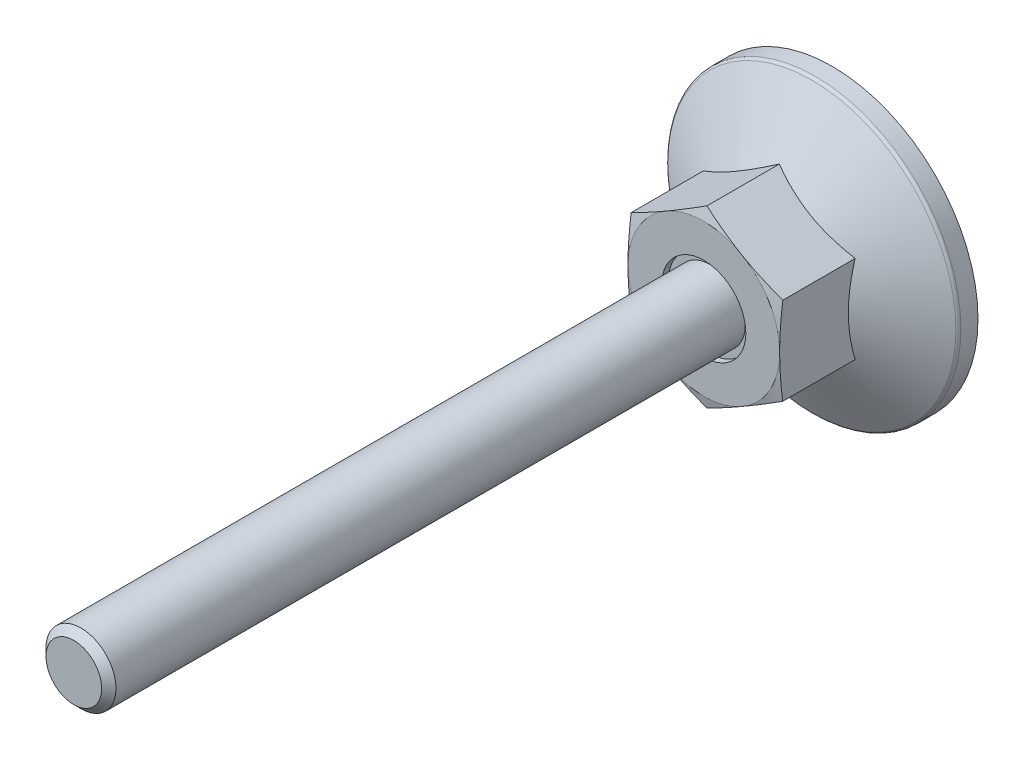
ISO-10303-21;
HEADER;
FILE_DESCRIPTION(('STEP AP214'),'2;1');
FILE_NAME('part.step','',(''),(''),'','','');
FILE_SCHEMA(('AUTOMOTIVE_DESIGN { 1 0 10303 214 1 1 1 1 }'));
ENDSEC;
DATA;
#1=APPLICATION_CONTEXT('core data for automotive mechanical design processes');
#2=APPLICATION_PROTOCOL_DEFINITION('international standard','automotive_design',2000,#1);
#3=PRODUCT_CONTEXT('',#1,'mechanical');
#4=PRODUCT('Part','Part','',(#3));
#5=PRODUCT_RELATED_PRODUCT_CATEGORY('part','',(#4));
#6=PRODUCT_DEFINITION_FORMATION('','',#4);
#7=PRODUCT_DEFINITION_CONTEXT('part definition',#1,'design');
#8=PRODUCT_DEFINITION('design','',#6,#7);
#9=PRODUCT_DEFINITION_SHAPE('','',#8);
#10=(LENGTH_UNIT() NAMED_UNIT(*) SI_UNIT(.MILLI.,.METRE.));
#11=(NAMED_UNIT(*) PLANE_ANGLE_UNIT() SI_UNIT($,.RADIAN.));
#12=(NAMED_UNIT(*) SI_UNIT($,.STERADIAN.) SOLID_ANGLE_UNIT());
#13=UNCERTAINTY_MEASURE_WITH_UNIT(LENGTH_MEASURE(1.E-05),#10,'distance_accuracy_value','');
#14=(GEOMETRIC_REPRESENTATION_CONTEXT(3) GLOBAL_UNCERTAINTY_ASSIGNED_CONTEXT((#13)) GLOBAL_UNIT_ASSIGNED_CONTEXT((#10,
#11,#12)) REPRESENTATION_CONTEXT('',''));
#15=CARTESIAN_POINT('',(0.,0.,0.));
#16=DIRECTION('',(0.,0.,1.));
#17=DIRECTION('',(1.,0.,0.));
#18=AXIS2_PLACEMENT_3D('',#15,#16,#17);
#19=CARTESIAN_POINT('',(0.,0.,10.45));
#20=DIRECTION('',(0.,0.,-1.));
#21=DIRECTION('',(0.,1.,0.));
#22=AXIS2_PLACEMENT_3D('',#19,#20,#21);
#23=PLANE('',#22);
#24=CARTESIAN_POINT('',(0.,0.,10.45));
#25=DIRECTION('',(0.,0.,-1.));
#26=DIRECTION('',(0.,1.,0.));
#27=AXIS2_PLACEMENT_3D('',#24,#25,#26);
#28=CIRCLE('',#27,3.6);
#29=CARTESIAN_POINT('',(0.,3.6,10.45));
#30=VERTEX_POINT('',#29);
#31=EDGE_CURVE('E27',#30,#30,#28,.T.);
#32=ORIENTED_EDGE('',*,*,#31,.F.);
#33=EDGE_LOOP('',(#32));
#34=FACE_BOUND('',#33,.T.);
#35=CARTESIAN_POINT('',(0.,0.,10.45));
#36=DIRECTION('',(0.,0.,-1.));
#37=DIRECTION('',(0.,1.,0.));
#38=AXIS2_PLACEMENT_3D('',#35,#36,#37);
#39=CIRCLE('',#38,3.);
#40=CARTESIAN_POINT('',(0.,3.,10.45));
#41=VERTEX_POINT('',#40);
#42=EDGE_CURVE('E252',#41,#41,#39,.F.);
#43=ORIENTED_EDGE('',*,*,#42,.F.);
#44=EDGE_LOOP('',(#43));
#45=FACE_BOUND('',#44,.T.);
#46=ADVANCED_FACE('F14',(#34,#45),#23,.F.);
#47=CARTESIAN_POINT('',(0.,7.5055534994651,22.));
#48=DIRECTION('',(0.499999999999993,-0.866025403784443,0.));
#49=DIRECTION('',(0.866025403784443,0.499999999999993,0.));
#50=AXIS2_PLACEMENT_3D('',#47,#48,#49);
#51=PLANE('',#50);
#52=CARTESIAN_POINT('',(-6.5002,3.75266127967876,4.53347836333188));
#53=CARTESIAN_POINT('',(-6.35732254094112,3.83515161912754,4.58109719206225));
#54=CARTESIAN_POINT('',(-6.21391236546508,3.91794952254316,4.62655491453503));
#55=CARTESIAN_POINT('',(-5.9259273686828,4.08421773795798,4.71255293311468));
#56=CARTESIAN_POINT('',(-5.78135207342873,4.16768832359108,4.7530911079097));
#57=CARTESIAN_POINT('',(-5.34531134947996,4.41943655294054,4.86653061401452));
#58=CARTESIAN_POINT('',(-5.05212471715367,4.58870793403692,4.93105380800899));
#59=CARTESIAN_POINT('',(-4.61337625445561,4.84201947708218,5.00671503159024));
#60=CARTESIAN_POINT('',(-4.46912536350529,4.92530276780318,5.02826875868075));
#61=CARTESIAN_POINT('',(-4.17997178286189,5.09224566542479,5.06441130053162));
#62=CARTESIAN_POINT('',(-4.03506915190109,5.17590523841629,5.07900073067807));
#63=CARTESIAN_POINT('',(-3.74501222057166,5.34336968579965,5.10084286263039));
#64=CARTESIAN_POINT('',(-3.59985839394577,5.42717428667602,5.10810389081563));
#65=CARTESIAN_POINT('',(-3.30942466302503,5.59485627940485,5.11514131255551));
#66=CARTESIAN_POINT('',(-3.16414476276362,5.67873366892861,5.11491793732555));
#67=CARTESIAN_POINT('',(-2.76612405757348,5.90853103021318,5.1040181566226));
#68=CARTESIAN_POINT('',(-2.51351353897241,6.05437578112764,5.08571979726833));
#69=CARTESIAN_POINT('',(-2.00997032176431,6.34509659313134,5.02769527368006));
#70=CARTESIAN_POINT('',(-1.75903939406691,6.48997163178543,4.9879492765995));
#71=CARTESIAN_POINT('',(-1.25448277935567,6.78127752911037,4.8885957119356));
#72=CARTESIAN_POINT('',(-1.00092075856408,6.92767163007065,4.82856718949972));
#73=CARTESIAN_POINT('',(-0.497578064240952,7.21827667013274,4.69232662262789));
#74=CARTESIAN_POINT('',(-0.247790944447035,7.36249133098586,4.61614658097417));
#75=CARTESIAN_POINT('',(0.000200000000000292,7.50566896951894,4.53347836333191));
#76=B_SPLINE_CURVE_WITH_KNOTS('',3,(#52,#53,#54,#55,#56,#57,#58,#59,#60,#61,#62,#63,#64,#65,#66,
#67,#68,#69,#70,#71,#72,#73,#74,#75),.UNSPECIFIED.,.F.,.F.,(4,2,2,2,2,2,2,2,2,2,2,4),(0.,
0.515105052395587,1.03043143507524,2.06322554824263,2.56697389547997,3.07067772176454,
3.57380860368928,4.07692394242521,4.95279354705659,5.82947446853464,6.72559912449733,
7.61996451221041),.UNSPECIFIED.);
#77=CARTESIAN_POINT('',(-6.5,3.7527767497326,4.53354503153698));
#78=VERTEX_POINT('',#77);
#79=CARTESIAN_POINT('',(0.,7.5055534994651,4.53354503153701));
#80=VERTEX_POINT('',#79);
#81=EDGE_CURVE('E100',#78,#80,#76,.T.);
#82=ORIENTED_EDGE('',*,*,#81,.F.);
#83=DIRECTION('',(0.,0.,-1.));
#84=VECTOR('',#83,1.);
#85=CARTESIAN_POINT('',(-6.5,3.7527767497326,22.));
#86=LINE('',#85,#84);
#87=CARTESIAN_POINT('',(-6.5,3.7527767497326,10.7305627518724));
#88=VERTEX_POINT('',#87);
#89=EDGE_CURVE('E91',#88,#78,#86,.T.);
#90=ORIENTED_EDGE('',*,*,#89,.F.);
#91=CARTESIAN_POINT('',(0.000200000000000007,7.50566896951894,10.7305318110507));
#92=CARTESIAN_POINT('',(-0.269745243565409,7.34981601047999,10.7723102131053));
#93=CARTESIAN_POINT('',(-0.540179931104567,7.19368047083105,10.8102381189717));
#94=CARTESIAN_POINT('',(-1.08200437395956,6.8808579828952,10.876873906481));
#95=CARTESIAN_POINT('',(-1.35339447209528,6.72417083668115,10.9055780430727));
#96=CARTESIAN_POINT('',(-1.89548428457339,6.41119513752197,10.952090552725));
#97=CARTESIAN_POINT('',(-2.16618033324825,6.25490870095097,10.9699543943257));
#98=CARTESIAN_POINT('',(-2.70791763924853,5.94213652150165,10.9939079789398));
#99=CARTESIAN_POINT('',(-2.97895881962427,5.78565082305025,11.));
#100=CARTESIAN_POINT('',(-3.52104118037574,5.47267942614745,11.));
#101=CARTESIAN_POINT('',(-3.79208236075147,5.31619372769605,10.9939079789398));
#102=CARTESIAN_POINT('',(-4.33381966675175,5.00342154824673,10.9699543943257));
#103=CARTESIAN_POINT('',(-4.60451571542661,4.84713511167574,10.952090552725));
#104=CARTESIAN_POINT('',(-5.14660552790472,4.53415941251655,10.9055780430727));
#105=CARTESIAN_POINT('',(-5.41799562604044,4.3774722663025,10.876873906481));
#106=CARTESIAN_POINT('',(-5.95982006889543,4.06464977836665,10.8102381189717));
#107=CARTESIAN_POINT('',(-6.23025475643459,3.90851423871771,10.7723102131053));
#108=CARTESIAN_POINT('',(-6.5002,3.75266127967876,10.7305318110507));
#109=B_SPLINE_CURVE_WITH_KNOTS('',3,(#91,#92,#93,#94,#95,#96,#97,#98,#99,#100,#101,#102,#103,
#104,#105,#106,#107,#108),.UNSPECIFIED.,.F.,.F.,(4,2,2,2,2,2,2,2,4),(0.,0.943529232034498,
1.88744107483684,2.82648138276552,3.76533995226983,4.70419852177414,5.64323882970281,
6.58715067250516,7.53067990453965),.UNSPECIFIED.);
#110=CARTESIAN_POINT('',(-3.24999999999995,5.62916512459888,11.));
#111=VERTEX_POINT('',#110);
#112=EDGE_CURVE('E191',#111,#88,#109,.T.);
#113=ORIENTED_EDGE('',*,*,#112,.F.);
#114=CARTESIAN_POINT('',(0.,7.5055534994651,10.7305627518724));
#115=VERTEX_POINT('',#114);
#116=EDGE_CURVE('E478',#115,#111,#109,.T.);
#117=ORIENTED_EDGE('',*,*,#116,.F.);
#118=DIRECTION('',(0.,0.,-1.));
#119=VECTOR('',#118,1.);
#120=CARTESIAN_POINT('',(0.,7.5055534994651,22.));
#121=LINE('',#120,#119);
#122=EDGE_CURVE('E104',#115,#80,#121,.T.);
#123=ORIENTED_EDGE('',*,*,#122,.T.);
#124=EDGE_LOOP('',(#82,#90,#113,#117,#123));
#125=FACE_BOUND('',#124,.T.);
#126=ADVANCED_FACE('F103',(#125),#51,.F.);
#127=CARTESIAN_POINT('',(6.5,3.7527767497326,22.));
#128=DIRECTION('',(-0.499999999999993,-0.866025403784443,0.));
#129=DIRECTION('',(0.866025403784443,-0.499999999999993,0.));
#130=AXIS2_PLACEMENT_3D('',#127,#128,#129);
#131=PLANE('',#130);
#132=CARTESIAN_POINT('',(-0.0002,7.50566896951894,4.53347836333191));
#133=CARTESIAN_POINT('',(0.142677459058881,7.42317863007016,4.58109719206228));
#134=CARTESIAN_POINT('',(0.286087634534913,7.34038072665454,4.62655491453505));
#135=CARTESIAN_POINT('',(0.574072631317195,7.17411251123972,4.71255293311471));
#136=CARTESIAN_POINT('',(0.718647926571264,7.09064192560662,4.75309110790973));
#137=CARTESIAN_POINT('',(1.15468865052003,6.83889369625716,4.86653061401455));
#138=CARTESIAN_POINT('',(1.44787528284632,6.66962231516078,4.93105380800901));
#139=CARTESIAN_POINT('',(1.88662374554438,6.41631077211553,5.00671503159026));
#140=CARTESIAN_POINT('',(2.03087463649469,6.33302748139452,5.02826875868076));
#141=CARTESIAN_POINT('',(2.32002821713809,6.16608458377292,5.06441130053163));
#142=CARTESIAN_POINT('',(2.46493084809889,6.08242501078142,5.07900073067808));
#143=CARTESIAN_POINT('',(2.75498777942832,5.91496056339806,5.10084286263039));
#144=CARTESIAN_POINT('',(2.90014160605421,5.8311559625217,5.10810389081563));
#145=CARTESIAN_POINT('',(3.19057533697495,5.66347396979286,5.11514131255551));
#146=CARTESIAN_POINT('',(3.33585523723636,5.5795965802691,5.11491793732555));
#147=CARTESIAN_POINT('',(3.73387594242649,5.34979921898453,5.10401815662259));
#148=CARTESIAN_POINT('',(3.98648646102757,5.20395446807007,5.08571979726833));
#149=CARTESIAN_POINT('',(4.49002967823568,4.91323365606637,5.02769527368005));
#150=CARTESIAN_POINT('',(4.74096060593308,4.76835861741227,4.98794927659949));
#151=CARTESIAN_POINT('',(5.24551722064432,4.47705272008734,4.88859571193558));
#152=CARTESIAN_POINT('',(5.49907924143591,4.33065861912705,4.8285671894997));
#153=CARTESIAN_POINT('',(6.00242193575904,4.04005357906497,4.69232662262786));
#154=CARTESIAN_POINT('',(6.25220905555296,3.89583891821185,4.61614658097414));
#155=CARTESIAN_POINT('',(6.5002,3.75266127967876,4.53347836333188));
#156=B_SPLINE_CURVE_WITH_KNOTS('',3,(#132,#133,#134,#135,#136,#137,#138,#139,#140,#141,#142,
#143,#144,#145,#146,#147,#148,#149,#150,#151,#152,#153,#154,#155),.UNSPECIFIED.,.F.,.F.,(4,2,2,
2,2,2,2,2,2,2,2,4),(0.,0.515105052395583,1.03043143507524,2.06322554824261,2.56697389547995,
3.07067772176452,3.57380860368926,4.07692394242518,4.95279354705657,5.82947446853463,
6.72559912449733,7.61996451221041),.UNSPECIFIED.);
#157=CARTESIAN_POINT('',(6.5,3.7527767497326,4.53354503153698));
#158=VERTEX_POINT('',#157);
#159=EDGE_CURVE('E34',#80,#158,#156,.T.);
#160=ORIENTED_EDGE('',*,*,#159,.F.);
#161=ORIENTED_EDGE('',*,*,#122,.F.);
#162=CARTESIAN_POINT('',(6.5002,3.75266127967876,10.7305318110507));
#163=CARTESIAN_POINT('',(6.23025475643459,3.90851423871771,10.7723102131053));
#164=CARTESIAN_POINT('',(5.95982006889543,4.06464977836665,10.8102381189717));
#165=CARTESIAN_POINT('',(5.41799562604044,4.37747226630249,10.876873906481));
#166=CARTESIAN_POINT('',(5.14660552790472,4.53415941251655,10.9055780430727));
#167=CARTESIAN_POINT('',(4.60451571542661,4.84713511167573,10.952090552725));
#168=CARTESIAN_POINT('',(4.33381966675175,5.00342154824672,10.9699543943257));
#169=CARTESIAN_POINT('',(3.79208236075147,5.31619372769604,10.9939079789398));
#170=CARTESIAN_POINT('',(3.52104118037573,5.47267942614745,11.));
#171=CARTESIAN_POINT('',(2.97895881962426,5.78565082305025,11.));
#172=CARTESIAN_POINT('',(2.70791763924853,5.94213652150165,10.9939079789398));
#173=CARTESIAN_POINT('',(2.16618033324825,6.25490870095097,10.9699543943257));
#174=CARTESIAN_POINT('',(1.89548428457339,6.41119513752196,10.952090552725));
#175=CARTESIAN_POINT('',(1.35339447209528,6.72417083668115,10.9055780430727));
#176=CARTESIAN_POINT('',(1.08200437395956,6.8808579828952,10.876873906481));
#177=CARTESIAN_POINT('',(0.540179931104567,7.19368047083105,10.8102381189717));
#178=CARTESIAN_POINT('',(0.26974524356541,7.34981601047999,10.7723102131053));
#179=CARTESIAN_POINT('',(-0.000199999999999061,7.50566896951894,10.7305318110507));
#180=B_SPLINE_CURVE_WITH_KNOTS('',3,(#162,#163,#164,#165,#166,#167,#168,#169,#170,#171,#172,
#173,#174,#175,#176,#177,#178,#179),.UNSPECIFIED.,.F.,.F.,(4,2,2,2,2,2,2,2,4),(0.,
0.943529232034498,1.88744107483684,2.82648138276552,3.76533995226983,4.70419852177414,
5.64323882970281,6.58715067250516,7.53067990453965),.UNSPECIFIED.);
#181=CARTESIAN_POINT('',(3.24999999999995,5.62916512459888,11.));
#182=VERTEX_POINT('',#181);
#183=EDGE_CURVE('E175',#182,#115,#180,.T.);
#184=ORIENTED_EDGE('',*,*,#183,.F.);
#185=CARTESIAN_POINT('',(6.5,3.7527767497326,10.7305627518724));
#186=VERTEX_POINT('',#185);
#187=EDGE_CURVE('E183',#186,#182,#180,.T.);
#188=ORIENTED_EDGE('',*,*,#187,.F.);
#189=DIRECTION('',(0.,0.,-1.));
#190=VECTOR('',#189,1.);
#191=CARTESIAN_POINT('',(6.5,3.7527767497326,22.));
#192=LINE('',#191,#190);
#193=EDGE_CURVE('E481',#186,#158,#192,.T.);
#194=ORIENTED_EDGE('',*,*,#193,.T.);
#195=EDGE_LOOP('',(#160,#161,#184,#188,#194));
#196=FACE_BOUND('',#195,.T.);
#197=ADVANCED_FACE('F165',(#196),#131,.F.);
#198=CARTESIAN_POINT('',(6.5,-3.7527767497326,22.));
#199=DIRECTION('',(-1.,0.,0.));
#200=DIRECTION('',(0.,-1.,0.));
#201=AXIS2_PLACEMENT_3D('',#198,#199,#200);
#202=PLANE('',#201);
#203=CARTESIAN_POINT('',(6.5,10.067414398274,1.94823609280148));
#204=CARTESIAN_POINT('',(6.5,9.78352438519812,2.0858958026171));
#205=CARTESIAN_POINT('',(6.5,9.49898106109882,2.22223138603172));
#206=CARTESIAN_POINT('',(6.5,8.9282401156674,2.49150895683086));
#207=CARTESIAN_POINT('',(6.5,8.64204224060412,2.62445040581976));
#208=CARTESIAN_POINT('',(6.5,8.06616487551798,2.88686541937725));
#209=CARTESIAN_POINT('',(6.5,7.77647490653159,3.01631606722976));
#210=CARTESIAN_POINT('',(6.5,7.19478507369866,3.26989907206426));
#211=CARTESIAN_POINT('',(6.5,6.90278532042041,3.3940316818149));
#212=CARTESIAN_POINT('',(6.5,6.30684739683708,3.6393457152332));
#213=CARTESIAN_POINT('',(6.5,6.00282105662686,3.76031411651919));
#214=CARTESIAN_POINT('',(6.5,5.39120706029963,3.99306391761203));
#215=CARTESIAN_POINT('',(6.5,5.08361900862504,4.10484428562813));
#216=CARTESIAN_POINT('',(6.5,4.46497231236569,4.31627594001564));
#217=CARTESIAN_POINT('',(6.5,4.15392216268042,4.41595183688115));
#218=CARTESIAN_POINT('',(6.5,3.52735818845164,4.59996747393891));
#219=CARTESIAN_POINT('',(6.5,3.21184580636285,4.6843120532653));
#220=CARTESIAN_POINT('',(6.5,2.57783458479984,4.83319256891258));
#221=CARTESIAN_POINT('',(6.5,2.25935972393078,4.8978289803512));
#222=CARTESIAN_POINT('',(6.5,1.61842059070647,5.00357646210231));
#223=CARTESIAN_POINT('',(6.5,1.29595672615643,5.04468991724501));
#224=CARTESIAN_POINT('',(6.5,0.812693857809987,5.08598811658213));
#225=CARTESIAN_POINT('',(6.5,0.652724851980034,5.09635596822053));
#226=CARTESIAN_POINT('',(6.5,0.332484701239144,5.110324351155));
#227=CARTESIAN_POINT('',(6.5,0.172213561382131,5.11392499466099));
#228=CARTESIAN_POINT('',(6.5,-0.148338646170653,5.11426557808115));
#229=CARTESIAN_POINT('',(6.5,-0.308619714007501,5.11100536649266));
#230=CARTESIAN_POINT('',(6.5,-0.628902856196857,5.09770543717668));
#231=CARTESIAN_POINT('',(6.5,-0.788904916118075,5.08766537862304));
#232=CARTESIAN_POINT('',(6.5,-1.1736673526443,5.05558094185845));
#233=CARTESIAN_POINT('',(6.5,-1.39816400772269,5.03030719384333));
#234=CARTESIAN_POINT('',(6.5,-1.84547349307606,4.96779217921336));
#235=CARTESIAN_POINT('',(6.5,-2.06828609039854,4.93054928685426));
#236=CARTESIAN_POINT('',(6.5,-2.73393776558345,4.80284369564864));
#237=CARTESIAN_POINT('',(6.5,-3.17375537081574,4.69642628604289));
#238=CARTESIAN_POINT('',(6.5,-3.83171733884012,4.51203063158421));
#239=CARTESIAN_POINT('',(6.5,-4.0532725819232,4.44552609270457));
#240=CARTESIAN_POINT('',(6.5,-4.49422901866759,4.30565892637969));
#241=CARTESIAN_POINT('',(6.5,-4.7136301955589,4.23229624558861));
#242=CARTESIAN_POINT('',(6.5,-5.15035386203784,4.07988627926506));
#243=CARTESIAN_POINT('',(6.5,-5.36767698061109,4.00084077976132));
#244=CARTESIAN_POINT('',(6.5,-5.800520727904,3.83799065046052));
#245=CARTESIAN_POINT('',(6.5,-6.01604140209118,3.75418614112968));
#246=CARTESIAN_POINT('',(6.5,-6.61842771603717,3.5135303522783));
#247=CARTESIAN_POINT('',(6.5,-7.00350435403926,3.35220459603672));
#248=CARTESIAN_POINT('',(6.5,-7.76959629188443,3.02014813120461));
#249=CARTESIAN_POINT('',(6.5,-8.15061109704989,2.84941629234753));
#250=CARTESIAN_POINT('',(6.5,-8.90957192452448,2.50088582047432));
#251=CARTESIAN_POINT('',(6.5,-9.28751663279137,2.32308433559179));
#252=CARTESIAN_POINT('',(6.5,-10.0408394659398,1.96218611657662));
#253=CARTESIAN_POINT('',(6.5,-10.4162177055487,1.77908962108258));
#254=CARTESIAN_POINT('',(6.5,-11.1655631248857,1.40849620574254));
#255=CARTESIAN_POINT('',(6.5,-11.5395269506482,1.22099251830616));
#256=CARTESIAN_POINT('',(6.5,-12.2858210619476,0.842758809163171));
#257=CARTESIAN_POINT('',(6.5,-12.6581513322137,0.652028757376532));
#258=CARTESIAN_POINT('',(6.5,-13.4013949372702,0.268043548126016));
#259=CARTESIAN_POINT('',(6.5,-13.7723085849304,0.0747889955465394));
#260=CARTESIAN_POINT('',(6.5,-14.5130449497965,-0.313800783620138));
#261=CARTESIAN_POINT('',(6.5,-14.8828676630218,-0.509136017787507));
#262=CARTESIAN_POINT('',(6.5,-15.9085714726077,-1.05391022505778));
#263=CARTESIAN_POINT('',(6.5,-16.5634819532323,-1.40517623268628));
#264=CARTESIAN_POINT('',(6.5,-17.871267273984,-2.11157255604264));
#265=CARTESIAN_POINT('',(6.5,-18.5241419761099,-2.46670312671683));
#266=CARTESIAN_POINT('',(6.5,-19.8261496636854,-3.17862531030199));
#267=CARTESIAN_POINT('',(6.5,-20.4752878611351,-3.53540739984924));
#268=CARTESIAN_POINT('',(6.5,-21.7722968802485,-4.25114422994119));
#269=CARTESIAN_POINT('',(6.5,-22.4201678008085,-4.61009879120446));
#270=CARTESIAN_POINT('',(6.5,-23.0675997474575,-4.9698379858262));
#271=B_SPLINE_CURVE_WITH_KNOTS('',3,(#203,#204,#205,#206,#207,#208,#209,#210,#211,#212,#213,
#214,#215,#216,#217,#218,#219,#220,#221,#222,#223,#224,#225,#226,#227,#228,#229,#230,#231,#232,
#233,#234,#235,#236,#237,#238,#239,#240,#241,#242,#243,#244,#245,#246,#247,#248,#249,#250,#251,
#252,#253,#254,#255,#256,#257,#258,#259,#260,#261,#262,#263,#264,#265,#266,#267,#268,#269,#270),
.UNSPECIFIED.,.F.,.F.,(4,2,2,2,2,2,2,2,2,2,2,2,2,2,2,2,2,2,2,2,2,2,2,2,2,2,2,2,2,2,2,2,2,4),(0.,
0.94652822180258,1.89320566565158,2.84505559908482,3.79686024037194,4.77837094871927,
5.75999172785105,6.73958204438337,7.71886262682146,8.69306383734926,9.66716626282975,
10.1479587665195,10.6287432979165,11.1095384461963,11.5903577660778,12.267719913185,
12.9451741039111,14.3007885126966,14.9946950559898,15.6886069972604,16.3823017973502,
17.0759790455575,18.3282990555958,19.5807698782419,20.8337511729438,22.086676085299,
23.3416700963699,24.5966758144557,25.8513861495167,27.1061010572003,29.3355785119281,
31.5652039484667,33.7873748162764,36.0093647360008),.UNSPECIFIED.);
#272=CARTESIAN_POINT('',(6.5,-3.7527767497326,4.53354503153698));
#273=VERTEX_POINT('',#272);
#274=EDGE_CURVE('E42',#158,#273,#271,.T.);
#275=ORIENTED_EDGE('',*,*,#274,.F.);
#276=ORIENTED_EDGE('',*,*,#193,.F.);
#277=CARTESIAN_POINT('',(6.5,9.92747995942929,9.56215186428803));
#278=CARTESIAN_POINT('',(6.5,9.63259364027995,9.62823955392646));
#279=CARTESIAN_POINT('',(6.5,9.33752287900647,9.69351898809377));
#280=CARTESIAN_POINT('',(6.5,8.74692189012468,9.82202506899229));
#281=CARTESIAN_POINT('',(6.5,8.45139164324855,9.88525162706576));
#282=CARTESIAN_POINT('',(6.5,7.85951636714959,10.0092707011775));
#283=CARTESIAN_POINT('',(6.5,7.56317082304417,10.0700607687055));
#284=CARTESIAN_POINT('',(6.5,6.9698629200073,10.1885506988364));
#285=CARTESIAN_POINT('',(6.5,6.67290056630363,10.2462505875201));
#286=CARTESIAN_POINT('',(6.5,6.08062010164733,10.3573796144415));
#287=CARTESIAN_POINT('',(6.5,5.78530770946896,10.410839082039));
#288=CARTESIAN_POINT('',(6.5,5.19387740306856,10.5130907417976));
#289=CARTESIAN_POINT('',(6.5,4.89775950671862,10.5618830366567));
#290=CARTESIAN_POINT('',(6.5,4.30466070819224,10.6537017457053));
#291=CARTESIAN_POINT('',(6.5,4.00767991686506,10.69672886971));
#292=CARTESIAN_POINT('',(6.5,3.41277328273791,10.7757492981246));
#293=CARTESIAN_POINT('',(6.5,3.11484743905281,10.8117425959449));
#294=CARTESIAN_POINT('',(6.5,2.51468954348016,10.8756761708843));
#295=CARTESIAN_POINT('',(6.5,2.21244707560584,10.9035201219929));
#296=CARTESIAN_POINT('',(6.5,1.60720229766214,10.9492341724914));
#297=CARTESIAN_POINT('',(6.5,1.30420000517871,10.9671045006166));
#298=CARTESIAN_POINT('',(6.5,0.697875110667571,10.9918290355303));
#299=CARTESIAN_POINT('',(6.5,0.394552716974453,10.9986882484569));
#300=CARTESIAN_POINT('',(6.5,-0.212135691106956,11.0009688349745));
#301=CARTESIAN_POINT('',(6.5,-0.515501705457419,10.9963902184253));
#302=CARTESIAN_POINT('',(6.5,-1.1229550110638,10.9760526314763));
#303=CARTESIAN_POINT('',(6.5,-1.42704091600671,10.9602530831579));
#304=CARTESIAN_POINT('',(6.5,-2.03449758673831,10.918375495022));
#305=CARTESIAN_POINT('',(6.5,-2.33786833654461,10.892297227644));
#306=CARTESIAN_POINT('',(6.5,-2.94389214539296,10.8311794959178));
#307=CARTESIAN_POINT('',(6.5,-3.24654460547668,10.7961341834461));
#308=CARTESIAN_POINT('',(6.5,-3.85087551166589,10.7185406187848));
#309=CARTESIAN_POINT('',(6.5,-4.15255395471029,10.6759923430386));
#310=CARTESIAN_POINT('',(6.5,-4.73502363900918,10.5877746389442));
#311=CARTESIAN_POINT('',(6.5,-5.01587505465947,10.5424985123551));
#312=CARTESIAN_POINT('',(6.5,-5.57683763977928,10.4475514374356));
#313=CARTESIAN_POINT('',(6.5,-5.85694878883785,10.3978803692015));
#314=CARTESIAN_POINT('',(6.5,-6.41653333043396,10.2949474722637));
#315=CARTESIAN_POINT('',(6.5,-6.69600666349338,10.2416853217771));
#316=CARTESIAN_POINT('',(6.5,-7.25437933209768,10.132225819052));
#317=CARTESIAN_POINT('',(6.5,-7.53327866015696,10.0760284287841));
#318=CARTESIAN_POINT('',(6.5,-8.36936246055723,9.90383082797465));
#319=CARTESIAN_POINT('',(6.5,-8.9258084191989,9.78424858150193));
#320=CARTESIAN_POINT('',(6.5,-10.0372205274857,9.53861051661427));
#321=CARTESIAN_POINT('',(6.5,-10.5921867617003,9.41255507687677));
#322=CARTESIAN_POINT('',(6.5,-11.6956125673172,9.15714489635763));
#323=CARTESIAN_POINT('',(6.5,-12.244082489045,9.02783474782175));
#324=CARTESIAN_POINT('',(6.5,-13.3402571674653,8.76597711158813));
#325=CARTESIAN_POINT('',(6.5,-13.8879619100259,8.6334295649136));
#326=CARTESIAN_POINT('',(6.5,-14.9821103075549,8.36610757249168));
#327=CARTESIAN_POINT('',(6.5,-15.528554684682,8.23133607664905));
#328=CARTESIAN_POINT('',(6.5,-16.6209674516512,7.95995280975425));
#329=CARTESIAN_POINT('',(6.5,-17.1669358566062,7.82334109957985));
#330=CARTESIAN_POINT('',(6.5,-17.7127383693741,7.6860776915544));
#331=B_SPLINE_CURVE_WITH_KNOTS('',3,(#277,#278,#279,#280,#281,#282,#283,#284,#285,#286,#287,
#288,#289,#290,#291,#292,#293,#294,#295,#296,#297,#298,#299,#300,#301,#302,#303,#304,#305,#306,
#307,#308,#309,#310,#311,#312,#313,#314,#315,#316,#317,#318,#319,#320,#321,#322,#323,#324,#325,
#326,#327,#328,#329,#330),.UNSPECIFIED.,.F.,.F.,(4,2,2,2,2,2,2,2,2,2,2,2,2,2,2,2,2,2,2,2,2,2,2,
2,2,2,4),(0.,0.906607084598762,1.8132532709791,2.72078883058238,3.62831672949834,
4.52862337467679,5.42891020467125,6.32908608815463,7.22926281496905,8.13968571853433,
9.05008774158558,9.96007573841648,10.8700629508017,11.7833577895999,12.6966728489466,
13.6105850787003,14.5245001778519,15.3778915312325,16.2313061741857,17.084797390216,
17.9382996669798,19.6456836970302,21.3529679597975,23.0434756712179,24.7340142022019,
26.4224665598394,28.1108631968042),.UNSPECIFIED.);
#332=CARTESIAN_POINT('',(6.5,0.,11.));
#333=VERTEX_POINT('',#332);
#334=EDGE_CURVE('E185',#333,#186,#331,.F.);
#335=ORIENTED_EDGE('',*,*,#334,.F.);
#336=CARTESIAN_POINT('',(6.5,-3.7527767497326,10.7305627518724));
#337=VERTEX_POINT('',#336);
#338=EDGE_CURVE('E184',#337,#333,#331,.F.);
#339=ORIENTED_EDGE('',*,*,#338,.F.);
#340=DIRECTION('',(0.,0.,-1.));
#341=VECTOR('',#340,1.);
#342=CARTESIAN_POINT('',(6.5,-3.7527767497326,22.));
#343=LINE('',#342,#341);
#344=EDGE_CURVE('E453',#337,#273,#343,.T.);
#345=ORIENTED_EDGE('',*,*,#344,.T.);
#346=EDGE_LOOP('',(#275,#276,#335,#339,#345));
#347=FACE_BOUND('',#346,.T.);
#348=ADVANCED_FACE('F169',(#347),#202,.F.);
#349=CARTESIAN_POINT('',(0.,-7.5055534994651,22.));
#350=DIRECTION('',(-0.499999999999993,0.866025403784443,0.));
#351=DIRECTION('',(-0.866025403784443,-0.499999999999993,0.));
#352=AXIS2_PLACEMENT_3D('',#349,#350,#351);
#353=PLANE('',#352);
#354=CARTESIAN_POINT('',(6.5002,-3.75266127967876,4.53347836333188));
#355=CARTESIAN_POINT('',(6.35732254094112,-3.83515161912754,4.58109719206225));
#356=CARTESIAN_POINT('',(6.21391236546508,-3.91794952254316,4.62655491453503));
#357=CARTESIAN_POINT('',(5.9259273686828,-4.08421773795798,4.71255293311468));
#358=CARTESIAN_POINT('',(5.78135207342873,-4.16768832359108,4.7530911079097));
#359=CARTESIAN_POINT('',(5.34531134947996,-4.41943655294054,4.86653061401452));
#360=CARTESIAN_POINT('',(5.05212471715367,-4.58870793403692,4.93105380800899));
#361=CARTESIAN_POINT('',(4.61337625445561,-4.84201947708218,5.00671503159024));
#362=CARTESIAN_POINT('',(4.46912536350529,-4.92530276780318,5.02826875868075));
#363=CARTESIAN_POINT('',(4.17997178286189,-5.09224566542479,5.06441130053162));
#364=CARTESIAN_POINT('',(4.03506915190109,-5.17590523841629,5.07900073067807));
#365=CARTESIAN_POINT('',(3.74501222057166,-5.34336968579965,5.10084286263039));
#366=CARTESIAN_POINT('',(3.59985839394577,-5.42717428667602,5.10810389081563));
#367=CARTESIAN_POINT('',(3.30942466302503,-5.59485627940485,5.11514131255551));
#368=CARTESIAN_POINT('',(3.16414476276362,-5.67873366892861,5.11491793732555));
#369=CARTESIAN_POINT('',(2.76612405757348,-5.90853103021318,5.1040181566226));
#370=CARTESIAN_POINT('',(2.51351353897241,-6.05437578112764,5.08571979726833));
#371=CARTESIAN_POINT('',(2.00997032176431,-6.34509659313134,5.02769527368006));
#372=CARTESIAN_POINT('',(1.75903939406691,-6.48997163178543,4.9879492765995));
#373=CARTESIAN_POINT('',(1.25448277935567,-6.78127752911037,4.8885957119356));
#374=CARTESIAN_POINT('',(1.00092075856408,-6.92767163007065,4.82856718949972));
#375=CARTESIAN_POINT('',(0.497578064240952,-7.21827667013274,4.69232662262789));
#376=CARTESIAN_POINT('',(0.247790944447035,-7.36249133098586,4.61614658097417));
#377=CARTESIAN_POINT('',(-0.000200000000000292,-7.50566896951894,4.53347836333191));
#378=B_SPLINE_CURVE_WITH_KNOTS('',3,(#354,#355,#356,#357,#358,#359,#360,#361,#362,#363,#364,
#365,#366,#367,#368,#369,#370,#371,#372,#373,#374,#375,#376,#377),.UNSPECIFIED.,.F.,.F.,(4,2,2,
2,2,2,2,2,2,2,2,4),(0.,0.515105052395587,1.03043143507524,2.06322554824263,2.56697389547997,
3.07067772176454,3.57380860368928,4.07692394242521,4.95279354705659,5.82947446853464,
6.72559912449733,7.61996451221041),.UNSPECIFIED.);
#379=CARTESIAN_POINT('',(0.,-7.5055534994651,4.53354503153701));
#380=VERTEX_POINT('',#379);
#381=EDGE_CURVE('E112',#273,#380,#378,.T.);
#382=ORIENTED_EDGE('',*,*,#381,.F.);
#383=ORIENTED_EDGE('',*,*,#344,.F.);
#384=CARTESIAN_POINT('',(-0.000200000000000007,-7.50566896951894,10.7305318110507));
#385=CARTESIAN_POINT('',(0.269745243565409,-7.34981601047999,10.7723102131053));
#386=CARTESIAN_POINT('',(0.540179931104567,-7.19368047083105,10.8102381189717));
#387=CARTESIAN_POINT('',(1.08200437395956,-6.8808579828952,10.876873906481));
#388=CARTESIAN_POINT('',(1.35339447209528,-6.72417083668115,10.9055780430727));
#389=CARTESIAN_POINT('',(1.89548428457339,-6.41119513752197,10.952090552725));
#390=CARTESIAN_POINT('',(2.16618033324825,-6.25490870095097,10.9699543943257));
#391=CARTESIAN_POINT('',(2.70791763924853,-5.94213652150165,10.9939079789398));
#392=CARTESIAN_POINT('',(2.97895881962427,-5.78565082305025,11.));
#393=CARTESIAN_POINT('',(3.52104118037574,-5.47267942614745,11.));
#394=CARTESIAN_POINT('',(3.79208236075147,-5.31619372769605,10.9939079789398));
#395=CARTESIAN_POINT('',(4.33381966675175,-5.00342154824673,10.9699543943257));
#396=CARTESIAN_POINT('',(4.60451571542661,-4.84713511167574,10.952090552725));
#397=CARTESIAN_POINT('',(5.14660552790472,-4.53415941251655,10.9055780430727));
#398=CARTESIAN_POINT('',(5.41799562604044,-4.3774722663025,10.876873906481));
#399=CARTESIAN_POINT('',(5.95982006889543,-4.06464977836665,10.8102381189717));
#400=CARTESIAN_POINT('',(6.23025475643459,-3.90851423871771,10.7723102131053));
#401=CARTESIAN_POINT('',(6.5002,-3.75266127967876,10.7305318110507));
#402=B_SPLINE_CURVE_WITH_KNOTS('',3,(#384,#385,#386,#387,#388,#389,#390,#391,#392,#393,#394,
#395,#396,#397,#398,#399,#400,#401),.UNSPECIFIED.,.F.,.F.,(4,2,2,2,2,2,2,2,4),(0.,
0.943529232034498,1.88744107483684,2.82648138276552,3.76533995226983,4.70419852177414,
5.64323882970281,6.58715067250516,7.53067990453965),.UNSPECIFIED.);
#403=CARTESIAN_POINT('',(3.24999999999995,-5.62916512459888,11.));
#404=VERTEX_POINT('',#403);
#405=EDGE_CURVE('E222',#404,#337,#402,.T.);
#406=ORIENTED_EDGE('',*,*,#405,.F.);
#407=CARTESIAN_POINT('',(0.,-7.5055534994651,10.7305627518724));
#408=VERTEX_POINT('',#407);
#409=EDGE_CURVE('E228',#408,#404,#402,.T.);
#410=ORIENTED_EDGE('',*,*,#409,.F.);
#411=DIRECTION('',(0.,0.,-1.));
#412=VECTOR('',#411,1.);
#413=CARTESIAN_POINT('',(0.,-7.5055534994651,22.));
#414=LINE('',#413,#412);
#415=EDGE_CURVE('E483',#408,#380,#414,.T.);
#416=ORIENTED_EDGE('',*,*,#415,.T.);
#417=EDGE_LOOP('',(#382,#383,#406,#410,#416));
#418=FACE_BOUND('',#417,.T.);
#419=ADVANCED_FACE('F230',(#418),#353,.F.);
#420=CARTESIAN_POINT('',(-6.5,-3.7527767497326,22.));
#421=DIRECTION('',(0.499999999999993,0.866025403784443,0.));
#422=DIRECTION('',(-0.866025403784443,0.499999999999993,0.));
#423=AXIS2_PLACEMENT_3D('',#420,#421,#422);
#424=PLANE('',#423);
#425=CARTESIAN_POINT('',(0.0002,-7.50566896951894,4.53347836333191));
#426=CARTESIAN_POINT('',(-0.142677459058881,-7.42317863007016,4.58109719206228));
#427=CARTESIAN_POINT('',(-0.286087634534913,-7.34038072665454,4.62655491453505));
#428=CARTESIAN_POINT('',(-0.574072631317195,-7.17411251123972,4.71255293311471));
#429=CARTESIAN_POINT('',(-0.718647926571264,-7.09064192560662,4.75309110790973));
#430=CARTESIAN_POINT('',(-1.15468865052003,-6.83889369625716,4.86653061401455));
#431=CARTESIAN_POINT('',(-1.44787528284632,-6.66962231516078,4.93105380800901));
#432=CARTESIAN_POINT('',(-1.88662374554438,-6.41631077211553,5.00671503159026));
#433=CARTESIAN_POINT('',(-2.03087463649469,-6.33302748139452,5.02826875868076));
#434=CARTESIAN_POINT('',(-2.32002821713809,-6.16608458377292,5.06441130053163));
#435=CARTESIAN_POINT('',(-2.46493084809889,-6.08242501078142,5.07900073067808));
#436=CARTESIAN_POINT('',(-2.75498777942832,-5.91496056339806,5.10084286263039));
#437=CARTESIAN_POINT('',(-2.90014160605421,-5.8311559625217,5.10810389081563));
#438=CARTESIAN_POINT('',(-3.19057533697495,-5.66347396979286,5.11514131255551));
#439=CARTESIAN_POINT('',(-3.33585523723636,-5.5795965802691,5.11491793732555));
#440=CARTESIAN_POINT('',(-3.73387594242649,-5.34979921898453,5.10401815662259));
#441=CARTESIAN_POINT('',(-3.98648646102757,-5.20395446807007,5.08571979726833));
#442=CARTESIAN_POINT('',(-4.49002967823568,-4.91323365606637,5.02769527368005));
#443=CARTESIAN_POINT('',(-4.74096060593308,-4.76835861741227,4.98794927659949));
#444=CARTESIAN_POINT('',(-5.24551722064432,-4.47705272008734,4.88859571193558));
#445=CARTESIAN_POINT('',(-5.49907924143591,-4.33065861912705,4.8285671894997));
#446=CARTESIAN_POINT('',(-6.00242193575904,-4.04005357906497,4.69232662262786));
#447=CARTESIAN_POINT('',(-6.25220905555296,-3.89583891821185,4.61614658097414));
#448=CARTESIAN_POINT('',(-6.5002,-3.75266127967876,4.53347836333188));
#449=B_SPLINE_CURVE_WITH_KNOTS('',3,(#425,#426,#427,#428,#429,#430,#431,#432,#433,#434,#435,
#436,#437,#438,#439,#440,#441,#442,#443,#444,#445,#446,#447,#448),.UNSPECIFIED.,.F.,.F.,(4,2,2,
2,2,2,2,2,2,2,2,4),(0.,0.515105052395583,1.03043143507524,2.06322554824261,2.56697389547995,
3.07067772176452,3.57380860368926,4.07692394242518,4.95279354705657,5.82947446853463,
6.72559912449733,7.61996451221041),.UNSPECIFIED.);
#450=CARTESIAN_POINT('',(-6.5,-3.7527767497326,4.53354503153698));
#451=VERTEX_POINT('',#450);
#452=EDGE_CURVE('E110',#380,#451,#449,.T.);
#453=ORIENTED_EDGE('',*,*,#452,.F.);
#454=ORIENTED_EDGE('',*,*,#415,.F.);
#455=CARTESIAN_POINT('',(-6.5002,-3.75266127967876,10.7305318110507));
#456=CARTESIAN_POINT('',(-6.23025475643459,-3.90851423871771,10.7723102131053));
#457=CARTESIAN_POINT('',(-5.95982006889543,-4.06464977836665,10.8102381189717));
#458=CARTESIAN_POINT('',(-5.41799562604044,-4.37747226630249,10.876873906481));
#459=CARTESIAN_POINT('',(-5.14660552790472,-4.53415941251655,10.9055780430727));
#460=CARTESIAN_POINT('',(-4.60451571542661,-4.84713511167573,10.952090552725));
#461=CARTESIAN_POINT('',(-4.33381966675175,-5.00342154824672,10.9699543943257));
#462=CARTESIAN_POINT('',(-3.79208236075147,-5.31619372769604,10.9939079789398));
#463=CARTESIAN_POINT('',(-3.52104118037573,-5.47267942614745,11.));
#464=CARTESIAN_POINT('',(-2.97895881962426,-5.78565082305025,11.));
#465=CARTESIAN_POINT('',(-2.70791763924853,-5.94213652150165,10.9939079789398));
#466=CARTESIAN_POINT('',(-2.16618033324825,-6.25490870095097,10.9699543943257));
#467=CARTESIAN_POINT('',(-1.89548428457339,-6.41119513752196,10.952090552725));
#468=CARTESIAN_POINT('',(-1.35339447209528,-6.72417083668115,10.9055780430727));
#469=CARTESIAN_POINT('',(-1.08200437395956,-6.8808579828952,10.876873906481));
#470=CARTESIAN_POINT('',(-0.540179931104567,-7.19368047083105,10.8102381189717));
#471=CARTESIAN_POINT('',(-0.26974524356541,-7.34981601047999,10.7723102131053));
#472=CARTESIAN_POINT('',(0.000199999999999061,-7.50566896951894,10.7305318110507));
#473=B_SPLINE_CURVE_WITH_KNOTS('',3,(#455,#456,#457,#458,#459,#460,#461,#462,#463,#464,#465,
#466,#467,#468,#469,#470,#471,#472),.UNSPECIFIED.,.F.,.F.,(4,2,2,2,2,2,2,2,4),(0.,
0.943529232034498,1.88744107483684,2.82648138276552,3.76533995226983,4.70419852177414,
5.64323882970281,6.58715067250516,7.53067990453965),.UNSPECIFIED.);
#474=CARTESIAN_POINT('',(-3.24999999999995,-5.62916512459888,11.));
#475=VERTEX_POINT('',#474);
#476=EDGE_CURVE('E216',#475,#408,#473,.T.);
#477=ORIENTED_EDGE('',*,*,#476,.F.);
#478=CARTESIAN_POINT('',(-6.5,-3.7527767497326,10.7305627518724));
#479=VERTEX_POINT('',#478);
#480=EDGE_CURVE('E229',#479,#475,#473,.T.);
#481=ORIENTED_EDGE('',*,*,#480,.F.);
#482=DIRECTION('',(0.,0.,-1.));
#483=VECTOR('',#482,1.);
#484=CARTESIAN_POINT('',(-6.5,-3.7527767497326,22.));
#485=LINE('',#484,#483);
#486=EDGE_CURVE('E99',#479,#451,#485,.T.);
#487=ORIENTED_EDGE('',*,*,#486,.T.);
#488=EDGE_LOOP('',(#453,#454,#477,#481,#487));
#489=FACE_BOUND('',#488,.T.);
#490=ADVANCED_FACE('F134',(#489),#424,.F.);
#491=CARTESIAN_POINT('',(-6.5,3.7527767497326,22.));
#492=DIRECTION('',(1.,0.,0.));
#493=DIRECTION('',(0.,1.,0.));
#494=AXIS2_PLACEMENT_3D('',#491,#492,#493);
#495=PLANE('',#494);
#496=CARTESIAN_POINT('',(-6.5,10.067414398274,1.94823609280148));
#497=CARTESIAN_POINT('',(-6.5,9.78352438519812,2.0858958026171));
#498=CARTESIAN_POINT('',(-6.5,9.49898106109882,2.22223138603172));
#499=CARTESIAN_POINT('',(-6.5,8.9282401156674,2.49150895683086));
#500=CARTESIAN_POINT('',(-6.5,8.64204224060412,2.62445040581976));
#501=CARTESIAN_POINT('',(-6.5,8.06616487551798,2.88686541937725));
#502=CARTESIAN_POINT('',(-6.5,7.77647490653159,3.01631606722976));
#503=CARTESIAN_POINT('',(-6.5,7.19478507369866,3.26989907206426));
#504=CARTESIAN_POINT('',(-6.5,6.90278532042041,3.3940316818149));
#505=CARTESIAN_POINT('',(-6.5,6.30684739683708,3.6393457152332));
#506=CARTESIAN_POINT('',(-6.5,6.00282105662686,3.76031411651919));
#507=CARTESIAN_POINT('',(-6.5,5.39120706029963,3.99306391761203));
#508=CARTESIAN_POINT('',(-6.5,5.08361900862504,4.10484428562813));
#509=CARTESIAN_POINT('',(-6.5,4.46497231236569,4.31627594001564));
#510=CARTESIAN_POINT('',(-6.5,4.15392216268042,4.41595183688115));
#511=CARTESIAN_POINT('',(-6.5,3.52735818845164,4.59996747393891));
#512=CARTESIAN_POINT('',(-6.5,3.21184580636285,4.6843120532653));
#513=CARTESIAN_POINT('',(-6.5,2.57783458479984,4.83319256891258));
#514=CARTESIAN_POINT('',(-6.5,2.25935972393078,4.8978289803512));
#515=CARTESIAN_POINT('',(-6.5,1.61842059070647,5.00357646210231));
#516=CARTESIAN_POINT('',(-6.5,1.29595672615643,5.04468991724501));
#517=CARTESIAN_POINT('',(-6.5,0.812693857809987,5.08598811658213));
#518=CARTESIAN_POINT('',(-6.5,0.652724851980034,5.09635596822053));
#519=CARTESIAN_POINT('',(-6.5,0.332484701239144,5.110324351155));
#520=CARTESIAN_POINT('',(-6.5,0.172213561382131,5.11392499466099));
#521=CARTESIAN_POINT('',(-6.5,-0.148338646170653,5.11426557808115));
#522=CARTESIAN_POINT('',(-6.5,-0.308619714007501,5.11100536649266));
#523=CARTESIAN_POINT('',(-6.5,-0.628902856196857,5.09770543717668));
#524=CARTESIAN_POINT('',(-6.5,-0.788904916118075,5.08766537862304));
#525=CARTESIAN_POINT('',(-6.5,-1.1736673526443,5.05558094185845));
#526=CARTESIAN_POINT('',(-6.5,-1.39816400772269,5.03030719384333));
#527=CARTESIAN_POINT('',(-6.5,-1.84547349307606,4.96779217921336));
#528=CARTESIAN_POINT('',(-6.5,-2.06828609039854,4.93054928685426));
#529=CARTESIAN_POINT('',(-6.5,-2.73393776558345,4.80284369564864));
#530=CARTESIAN_POINT('',(-6.5,-3.17375537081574,4.69642628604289));
#531=CARTESIAN_POINT('',(-6.5,-3.83171733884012,4.51203063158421));
#532=CARTESIAN_POINT('',(-6.5,-4.0532725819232,4.44552609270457));
#533=CARTESIAN_POINT('',(-6.5,-4.49422901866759,4.30565892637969));
#534=CARTESIAN_POINT('',(-6.5,-4.7136301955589,4.23229624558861));
#535=CARTESIAN_POINT('',(-6.5,-5.15035386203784,4.07988627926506));
#536=CARTESIAN_POINT('',(-6.5,-5.36767698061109,4.00084077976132));
#537=CARTESIAN_POINT('',(-6.5,-5.800520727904,3.83799065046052));
#538=CARTESIAN_POINT('',(-6.5,-6.01604140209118,3.75418614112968));
#539=CARTESIAN_POINT('',(-6.5,-6.61842771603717,3.5135303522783));
#540=CARTESIAN_POINT('',(-6.5,-7.00350435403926,3.35220459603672));
#541=CARTESIAN_POINT('',(-6.5,-7.76959629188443,3.02014813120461));
#542=CARTESIAN_POINT('',(-6.5,-8.15061109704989,2.84941629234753));
#543=CARTESIAN_POINT('',(-6.5,-8.90957192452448,2.50088582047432));
#544=CARTESIAN_POINT('',(-6.5,-9.28751663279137,2.32308433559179));
#545=CARTESIAN_POINT('',(-6.5,-10.0408394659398,1.96218611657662));
#546=CARTESIAN_POINT('',(-6.5,-10.4162177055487,1.77908962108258));
#547=CARTESIAN_POINT('',(-6.5,-11.1655631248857,1.40849620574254));
#548=CARTESIAN_POINT('',(-6.5,-11.5395269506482,1.22099251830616));
#549=CARTESIAN_POINT('',(-6.5,-12.2858210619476,0.842758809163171));
#550=CARTESIAN_POINT('',(-6.5,-12.6581513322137,0.652028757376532));
#551=CARTESIAN_POINT('',(-6.5,-13.4013949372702,0.268043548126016));
#552=CARTESIAN_POINT('',(-6.5,-13.7723085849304,0.0747889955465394));
#553=CARTESIAN_POINT('',(-6.5,-14.5130449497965,-0.313800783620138));
#554=CARTESIAN_POINT('',(-6.5,-14.8828676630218,-0.509136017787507));
#555=CARTESIAN_POINT('',(-6.5,-15.9085714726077,-1.05391022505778));
#556=CARTESIAN_POINT('',(-6.5,-16.5634819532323,-1.40517623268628));
#557=CARTESIAN_POINT('',(-6.5,-17.871267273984,-2.11157255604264));
#558=CARTESIAN_POINT('',(-6.5,-18.5241419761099,-2.46670312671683));
#559=CARTESIAN_POINT('',(-6.5,-19.8261496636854,-3.17862531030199));
#560=CARTESIAN_POINT('',(-6.5,-20.4752878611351,-3.53540739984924));
#561=CARTESIAN_POINT('',(-6.5,-21.7722968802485,-4.25114422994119));
#562=CARTESIAN_POINT('',(-6.5,-22.4201678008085,-4.61009879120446));
#563=CARTESIAN_POINT('',(-6.5,-23.0675997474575,-4.9698379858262));
#564=B_SPLINE_CURVE_WITH_KNOTS('',3,(#496,#497,#498,#499,#500,#501,#502,#503,#504,#505,#506,
#507,#508,#509,#510,#511,#512,#513,#514,#515,#516,#517,#518,#519,#520,#521,#522,#523,#524,#525,
#526,#527,#528,#529,#530,#531,#532,#533,#534,#535,#536,#537,#538,#539,#540,#541,#542,#543,#544,
#545,#546,#547,#548,#549,#550,#551,#552,#553,#554,#555,#556,#557,#558,#559,#560,#561,#562,#563),
.UNSPECIFIED.,.F.,.F.,(4,2,2,2,2,2,2,2,2,2,2,2,2,2,2,2,2,2,2,2,2,2,2,2,2,2,2,2,2,2,2,2,2,4),(0.,
0.94652822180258,1.89320566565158,2.84505559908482,3.79686024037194,4.77837094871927,
5.75999172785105,6.73958204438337,7.71886262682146,8.69306383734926,9.66716626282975,
10.1479587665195,10.6287432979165,11.1095384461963,11.5903577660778,12.267719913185,
12.9451741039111,14.3007885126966,14.9946950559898,15.6886069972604,16.3823017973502,
17.0759790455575,18.3282990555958,19.5807698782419,20.8337511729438,22.086676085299,
23.3416700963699,24.5966758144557,25.8513861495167,27.1061010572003,29.3355785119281,
31.5652039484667,33.7873748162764,36.0093647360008),.UNSPECIFIED.);
#565=EDGE_CURVE('E9',#451,#78,#564,.F.);
#566=ORIENTED_EDGE('',*,*,#565,.F.);
#567=ORIENTED_EDGE('',*,*,#486,.F.);
#568=CARTESIAN_POINT('',(-6.5,9.92747995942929,9.56215186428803));
#569=CARTESIAN_POINT('',(-6.5,9.63259364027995,9.62823955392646));
#570=CARTESIAN_POINT('',(-6.5,9.33752287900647,9.69351898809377));
#571=CARTESIAN_POINT('',(-6.5,8.74692189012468,9.82202506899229));
#572=CARTESIAN_POINT('',(-6.5,8.45139164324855,9.88525162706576));
#573=CARTESIAN_POINT('',(-6.5,7.85951636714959,10.0092707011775));
#574=CARTESIAN_POINT('',(-6.5,7.56317082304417,10.0700607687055));
#575=CARTESIAN_POINT('',(-6.5,6.9698629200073,10.1885506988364));
#576=CARTESIAN_POINT('',(-6.5,6.67290056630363,10.2462505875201));
#577=CARTESIAN_POINT('',(-6.5,6.08062010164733,10.3573796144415));
#578=CARTESIAN_POINT('',(-6.5,5.78530770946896,10.410839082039));
#579=CARTESIAN_POINT('',(-6.5,5.19387740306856,10.5130907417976));
#580=CARTESIAN_POINT('',(-6.5,4.89775950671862,10.5618830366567));
#581=CARTESIAN_POINT('',(-6.5,4.30466070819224,10.6537017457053));
#582=CARTESIAN_POINT('',(-6.5,4.00767991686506,10.69672886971));
#583=CARTESIAN_POINT('',(-6.5,3.41277328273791,10.7757492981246));
#584=CARTESIAN_POINT('',(-6.5,3.11484743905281,10.8117425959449));
#585=CARTESIAN_POINT('',(-6.5,2.51468954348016,10.8756761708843));
#586=CARTESIAN_POINT('',(-6.5,2.21244707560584,10.9035201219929));
#587=CARTESIAN_POINT('',(-6.5,1.60720229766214,10.9492341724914));
#588=CARTESIAN_POINT('',(-6.5,1.30420000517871,10.9671045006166));
#589=CARTESIAN_POINT('',(-6.5,0.697875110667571,10.9918290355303));
#590=CARTESIAN_POINT('',(-6.5,0.394552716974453,10.9986882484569));
#591=CARTESIAN_POINT('',(-6.5,-0.212135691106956,11.0009688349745));
#592=CARTESIAN_POINT('',(-6.5,-0.515501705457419,10.9963902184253));
#593=CARTESIAN_POINT('',(-6.5,-1.1229550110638,10.9760526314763));
#594=CARTESIAN_POINT('',(-6.5,-1.42704091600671,10.9602530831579));
#595=CARTESIAN_POINT('',(-6.5,-2.03449758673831,10.918375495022));
#596=CARTESIAN_POINT('',(-6.5,-2.33786833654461,10.892297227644));
#597=CARTESIAN_POINT('',(-6.5,-2.94389214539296,10.8311794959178));
#598=CARTESIAN_POINT('',(-6.5,-3.24654460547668,10.7961341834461));
#599=CARTESIAN_POINT('',(-6.5,-3.85087551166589,10.7185406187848));
#600=CARTESIAN_POINT('',(-6.5,-4.15255395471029,10.6759923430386));
#601=CARTESIAN_POINT('',(-6.5,-4.73502363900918,10.5877746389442));
#602=CARTESIAN_POINT('',(-6.5,-5.01587505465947,10.5424985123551));
#603=CARTESIAN_POINT('',(-6.5,-5.57683763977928,10.4475514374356));
#604=CARTESIAN_POINT('',(-6.5,-5.85694878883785,10.3978803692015));
#605=CARTESIAN_POINT('',(-6.5,-6.41653333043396,10.2949474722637));
#606=CARTESIAN_POINT('',(-6.5,-6.69600666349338,10.2416853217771));
#607=CARTESIAN_POINT('',(-6.5,-7.25437933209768,10.132225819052));
#608=CARTESIAN_POINT('',(-6.5,-7.53327866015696,10.0760284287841));
#609=CARTESIAN_POINT('',(-6.5,-8.36936246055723,9.90383082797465));
#610=CARTESIAN_POINT('',(-6.5,-8.9258084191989,9.78424858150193));
#611=CARTESIAN_POINT('',(-6.5,-10.0372205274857,9.53861051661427));
#612=CARTESIAN_POINT('',(-6.5,-10.5921867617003,9.41255507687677));
#613=CARTESIAN_POINT('',(-6.5,-11.6956125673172,9.15714489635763));
#614=CARTESIAN_POINT('',(-6.5,-12.244082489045,9.02783474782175));
#615=CARTESIAN_POINT('',(-6.5,-13.3402571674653,8.76597711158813));
#616=CARTESIAN_POINT('',(-6.5,-13.8879619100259,8.6334295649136));
#617=CARTESIAN_POINT('',(-6.5,-14.9821103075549,8.36610757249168));
#618=CARTESIAN_POINT('',(-6.5,-15.528554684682,8.23133607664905));
#619=CARTESIAN_POINT('',(-6.5,-16.6209674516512,7.95995280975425));
#620=CARTESIAN_POINT('',(-6.5,-17.1669358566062,7.82334109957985));
#621=CARTESIAN_POINT('',(-6.5,-17.7127383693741,7.6860776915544));
#622=B_SPLINE_CURVE_WITH_KNOTS('',3,(#568,#569,#570,#571,#572,#573,#574,#575,#576,#577,#578,
#579,#580,#581,#582,#583,#584,#585,#586,#587,#588,#589,#590,#591,#592,#593,#594,#595,#596,#597,
#598,#599,#600,#601,#602,#603,#604,#605,#606,#607,#608,#609,#610,#611,#612,#613,#614,#615,#616,
#617,#618,#619,#620,#621),.UNSPECIFIED.,.F.,.F.,(4,2,2,2,2,2,2,2,2,2,2,2,2,2,2,2,2,2,2,2,2,2,2,
2,2,2,4),(0.,0.906607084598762,1.8132532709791,2.72078883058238,3.62831672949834,
4.52862337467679,5.42891020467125,6.32908608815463,7.22926281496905,8.13968571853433,
9.05008774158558,9.96007573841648,10.8700629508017,11.7833577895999,12.6966728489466,
13.6105850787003,14.5245001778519,15.3778915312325,16.2313061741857,17.084797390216,
17.9382996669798,19.6456836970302,21.3529679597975,23.0434756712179,24.7340142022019,
26.4224665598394,28.1108631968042),.UNSPECIFIED.);
#623=CARTESIAN_POINT('',(-6.5,0.,11.));
#624=VERTEX_POINT('',#623);
#625=EDGE_CURVE('E207',#624,#479,#622,.T.);
#626=ORIENTED_EDGE('',*,*,#625,.F.);
#627=EDGE_CURVE('E96',#88,#624,#622,.T.);
#628=ORIENTED_EDGE('',*,*,#627,.F.);
#629=ORIENTED_EDGE('',*,*,#89,.T.);
#630=EDGE_LOOP('',(#566,#567,#626,#628,#629));
#631=FACE_BOUND('',#630,.T.);
#632=ADVANCED_FACE('F93',(#631),#495,.F.);
#633=CARTESIAN_POINT('',(0.,0.,11.));
#634=DIRECTION('',(0.,0.,-1.));
#635=DIRECTION('',(0.,1.,0.));
#636=AXIS2_PLACEMENT_3D('',#633,#634,#635);
#637=CONICAL_SURFACE('',#636,6.5,1.30899693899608);
#638=ORIENTED_EDGE('',*,*,#405,.T.);
#639=ORIENTED_EDGE('',*,*,#338,.T.);
#640=CARTESIAN_POINT('',(0.,0.,11.));
#641=DIRECTION('',(0.,0.,-1.));
#642=DIRECTION('',(0.,1.,0.));
#643=AXIS2_PLACEMENT_3D('',#640,#641,#642);
#644=CIRCLE('',#643,6.5);
#645=EDGE_CURVE('E450',#333,#404,#644,.T.);
#646=ORIENTED_EDGE('',*,*,#645,.T.);
#647=EDGE_LOOP('',(#638,#639,#646));
#648=FACE_BOUND('',#647,.T.);
#649=ADVANCED_FACE('F202',(#648),#637,.T.);
#650=EDGE_CURVE('E465',#182,#333,#644,.T.);
#651=ORIENTED_EDGE('',*,*,#650,.T.);
#652=ORIENTED_EDGE('',*,*,#334,.T.);
#653=ORIENTED_EDGE('',*,*,#187,.T.);
#654=EDGE_LOOP('',(#651,#652,#653));
#655=FACE_BOUND('',#654,.T.);
#656=ADVANCED_FACE('F377',(#655),#637,.T.);
#657=EDGE_CURVE('E474',#111,#182,#644,.T.);
#658=ORIENTED_EDGE('',*,*,#657,.T.);
#659=ORIENTED_EDGE('',*,*,#183,.T.);
#660=ORIENTED_EDGE('',*,*,#116,.T.);
#661=EDGE_LOOP('',(#658,#659,#660));
#662=FACE_BOUND('',#661,.T.);
#663=ADVANCED_FACE('F370',(#662),#637,.T.);
#664=ORIENTED_EDGE('',*,*,#476,.T.);
#665=ORIENTED_EDGE('',*,*,#409,.T.);
#666=EDGE_CURVE('E457',#404,#475,#644,.T.);
#667=ORIENTED_EDGE('',*,*,#666,.T.);
#668=EDGE_LOOP('',(#664,#665,#667));
#669=FACE_BOUND('',#668,.T.);
#670=ADVANCED_FACE('F363',(#669),#637,.T.);
#671=EDGE_CURVE('E466',#624,#111,#644,.T.);
#672=ORIENTED_EDGE('',*,*,#671,.T.);
#673=ORIENTED_EDGE('',*,*,#112,.T.);
#674=ORIENTED_EDGE('',*,*,#627,.T.);
#675=EDGE_LOOP('',(#672,#673,#674));
#676=FACE_BOUND('',#675,.T.);
#677=ADVANCED_FACE('F203',(#676),#637,.T.);
#678=CARTESIAN_POINT('',(0.,0.,0.));
#679=DIRECTION('',(0.,0.,-1.));
#680=DIRECTION('',(0.,1.,0.));
#681=AXIS2_PLACEMENT_3D('',#678,#679,#680);
#682=CYLINDRICAL_SURFACE('',#681,3.6);
#683=CARTESIAN_POINT('',(0.,0.,11.));
#684=DIRECTION('',(0.,0.,-1.));
#685=DIRECTION('',(0.,1.,0.));
#686=AXIS2_PLACEMENT_3D('',#683,#684,#685);
#687=CIRCLE('',#686,3.6);
#688=CARTESIAN_POINT('',(0.,3.6,11.));
#689=VERTEX_POINT('',#688);
#690=EDGE_CURVE('E464',#689,#689,#687,.T.);
#691=ORIENTED_EDGE('',*,*,#690,.F.);
#692=EDGE_LOOP('',(#691));
#693=FACE_BOUND('',#692,.T.);
#694=ORIENTED_EDGE('',*,*,#31,.T.);
#695=EDGE_LOOP('',(#694));
#696=FACE_BOUND('',#695,.T.);
#697=ADVANCED_FACE('F350',(#693,#696),#682,.F.);
#698=CARTESIAN_POINT('',(3.6,0.,11.));
#699=DIRECTION('',(0.,0.,-1.));
#700=DIRECTION('',(0.,1.,0.));
#701=AXIS2_PLACEMENT_3D('',#698,#699,#700);
#702=PLANE('',#701);
#703=ORIENTED_EDGE('',*,*,#645,.F.);
#704=ORIENTED_EDGE('',*,*,#650,.F.);
#705=ORIENTED_EDGE('',*,*,#657,.F.);
#706=ORIENTED_EDGE('',*,*,#671,.F.);
#707=EDGE_CURVE('E463',#475,#624,#644,.T.);
#708=ORIENTED_EDGE('',*,*,#707,.F.);
#709=ORIENTED_EDGE('',*,*,#666,.F.);
#710=EDGE_LOOP('',(#703,#704,#705,#706,#708,#709));
#711=FACE_BOUND('',#710,.T.);
#712=ORIENTED_EDGE('',*,*,#690,.T.);
#713=EDGE_LOOP('',(#712));
#714=FACE_BOUND('',#713,.T.);
#715=ADVANCED_FACE('F200',(#711,#714),#702,.F.);
#716=ORIENTED_EDGE('',*,*,#625,.T.);
#717=ORIENTED_EDGE('',*,*,#480,.T.);
#718=ORIENTED_EDGE('',*,*,#707,.T.);
#719=EDGE_LOOP('',(#716,#717,#718));
#720=FACE_BOUND('',#719,.T.);
#721=ADVANCED_FACE('F141',(#720),#637,.T.);
#722=CARTESIAN_POINT('',(0.,0.,8.8668783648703));
#723=DIRECTION('',(0.,0.,-1.));
#724=DIRECTION('',(0.,1.,0.));
#725=AXIS2_PLACEMENT_3D('',#722,#723,#724);
#726=CONICAL_SURFACE('',#725,0.,1.0471975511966);
#727=CARTESIAN_POINT('',(0.,0.,1.7402109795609));
#728=DIRECTION('',(0.,0.,-1.));
#729=DIRECTION('',(0.,1.,0.));
#730=AXIS2_PLACEMENT_3D('',#727,#728,#729);
#731=CIRCLE('',#730,12.34375);
#732=CARTESIAN_POINT('',(0.,12.34375,1.7402109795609));
#733=VERTEX_POINT('',#732);
#734=EDGE_CURVE('E116',#733,#733,#731,.T.);
#735=ORIENTED_EDGE('',*,*,#734,.F.);
#736=EDGE_LOOP('',(#735));
#737=FACE_BOUND('',#736,.T.);
#738=ORIENTED_EDGE('',*,*,#565,.T.);
#739=ORIENTED_EDGE('',*,*,#81,.T.);
#740=ORIENTED_EDGE('',*,*,#159,.T.);
#741=ORIENTED_EDGE('',*,*,#274,.T.);
#742=ORIENTED_EDGE('',*,*,#381,.T.);
#743=ORIENTED_EDGE('',*,*,#452,.T.);
#744=EDGE_LOOP('',(#738,#739,#740,#741,#742,#743));
#745=FACE_BOUND('',#744,.T.);
#746=ADVANCED_FACE('F108',(#737,#745),#726,.T.);
#747=CARTESIAN_POINT('',(0.,0.,1.46957804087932));
#748=DIRECTION('',(0.,0.,-1.));
#749=DIRECTION('',(0.,1.,0.));
#750=AXIS2_PLACEMENT_3D('',#747,#748,#749);
#751=TOROIDAL_SURFACE('',#750,12.1875000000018,0.312499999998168);
#752=ORIENTED_EDGE('',*,*,#734,.T.);
#753=EDGE_LOOP('',(#752));
#754=FACE_BOUND('',#753,.T.);
#755=CARTESIAN_POINT('',(0.,0.,1.46957804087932));
#756=DIRECTION('',(0.,0.,-1.));
#757=DIRECTION('',(0.,1.,0.));
#758=AXIS2_PLACEMENT_3D('',#755,#756,#757);
#759=CIRCLE('',#758,12.5);
#760=CARTESIAN_POINT('',(0.,12.5,1.46957804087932));
#761=VERTEX_POINT('',#760);
#762=EDGE_CURVE('E120',#761,#761,#759,.T.);
#763=ORIENTED_EDGE('',*,*,#762,.F.);
#764=EDGE_LOOP('',(#763));
#765=FACE_BOUND('',#764,.T.);
#766=ADVANCED_FACE('F140',(#754,#765),#751,.T.);
#767=CARTESIAN_POINT('',(0.,0.,0.));
#768=DIRECTION('',(0.,0.,-1.));
#769=DIRECTION('',(0.,1.,0.));
#770=AXIS2_PLACEMENT_3D('',#767,#768,#769);
#771=CYLINDRICAL_SURFACE('',#770,12.5);
#772=CARTESIAN_POINT('',(0.,0.,0.));
#773=DIRECTION('',(0.,0.,-1.));
#774=DIRECTION('',(0.,1.,0.));
#775=AXIS2_PLACEMENT_3D('',#772,#773,#774);
#776=CIRCLE('',#775,12.5);
#777=CARTESIAN_POINT('',(0.,12.5,0.));
#778=VERTEX_POINT('',#777);
#779=EDGE_CURVE('E254',#778,#778,#776,.T.);
#780=ORIENTED_EDGE('',*,*,#779,.F.);
#781=EDGE_LOOP('',(#780));
#782=FACE_BOUND('',#781,.T.);
#783=ORIENTED_EDGE('',*,*,#762,.T.);
#784=EDGE_LOOP('',(#783));
#785=FACE_BOUND('',#784,.T.);
#786=ADVANCED_FACE('F266',(#782,#785),#771,.T.);
#787=CARTESIAN_POINT('',(7.8,0.,0.));
#788=DIRECTION('',(0.,0.,1.));
#789=DIRECTION('',(0.,-1.,0.));
#790=AXIS2_PLACEMENT_3D('',#787,#788,#789);
#791=PLANE('',#790);
#792=ORIENTED_EDGE('',*,*,#779,.T.);
#793=EDGE_LOOP('',(#792));
#794=FACE_BOUND('',#793,.T.);
#795=ADVANCED_FACE('F171',(#794),#791,.F.);
#796=CARTESIAN_POINT('',(0.,0.,0.));
#797=DIRECTION('',(0.,0.,-1.));
#798=DIRECTION('',(0.,1.,0.));
#799=AXIS2_PLACEMENT_3D('',#796,#797,#798);
#800=CYLINDRICAL_SURFACE('',#799,3.);
#801=ORIENTED_EDGE('',*,*,#42,.T.);
#802=EDGE_LOOP('',(#801));
#803=FACE_BOUND('',#802,.T.);
#804=CARTESIAN_POINT('',(0.,0.,64.3865));
#805=DIRECTION('',(0.,0.,-1.));
#806=DIRECTION('',(0.,1.,0.));
#807=AXIS2_PLACEMENT_3D('',#804,#805,#806);
#808=CIRCLE('',#807,3.);
#809=CARTESIAN_POINT('',(0.,3.,64.3865));
#810=VERTEX_POINT('',#809);
#811=EDGE_CURVE('E260',#810,#810,#808,.T.);
#812=ORIENTED_EDGE('',*,*,#811,.T.);
#813=EDGE_LOOP('',(#812));
#814=FACE_BOUND('',#813,.T.);
#815=ADVANCED_FACE('F280',(#803,#814),#800,.T.);
#816=CARTESIAN_POINT('',(0.,0.,65.));
#817=DIRECTION('',(0.,0.,-1.));
#818=DIRECTION('',(0.,1.,0.));
#819=AXIS2_PLACEMENT_3D('',#816,#817,#818);
#820=PLANE('',#819);
#821=CARTESIAN_POINT('',(0.,0.,65.));
#822=DIRECTION('',(0.,0.,-1.));
#823=DIRECTION('',(0.,1.,0.));
#824=AXIS2_PLACEMENT_3D('',#821,#822,#823);
#825=CIRCLE('',#824,2.3865);
#826=CARTESIAN_POINT('',(0.,2.3865,65.));
#827=VERTEX_POINT('',#826);
#828=EDGE_CURVE('E255',#827,#827,#825,.T.);
#829=ORIENTED_EDGE('',*,*,#828,.F.);
#830=EDGE_LOOP('',(#829));
#831=FACE_BOUND('',#830,.T.);
#832=ADVANCED_FACE('F284',(#831),#820,.F.);
#833=CARTESIAN_POINT('',(0.,0.,65.));
#834=DIRECTION('',(0.,0.,-1.));
#835=DIRECTION('',(0.,1.,0.));
#836=AXIS2_PLACEMENT_3D('',#833,#834,#835);
#837=CONICAL_SURFACE('',#836,2.3865,0.785398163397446);
#838=ORIENTED_EDGE('',*,*,#811,.F.);
#839=EDGE_LOOP('',(#838));
#840=FACE_BOUND('',#839,.T.);
#841=ORIENTED_EDGE('',*,*,#828,.T.);
#842=EDGE_LOOP('',(#841));
#843=FACE_BOUND('',#842,.T.);
#844=ADVANCED_FACE('F287',(#840,#843),#837,.T.);
#845=CLOSED_SHELL('',(#46,#126,#197,#348,#419,#490,#632,#649,#656,#663,#670,#677,#697,#715,#721,
#746,#766,#786,#795,#815,#832,#844));
#846=MANIFOLD_SOLID_BREP('B1',#845);
#847=ADVANCED_BREP_SHAPE_REPRESENTATION('',(#18,#846),#14);
#848=SHAPE_DEFINITION_REPRESENTATION(#9,#847);
ENDSEC;
END-ISO-10303-21;
